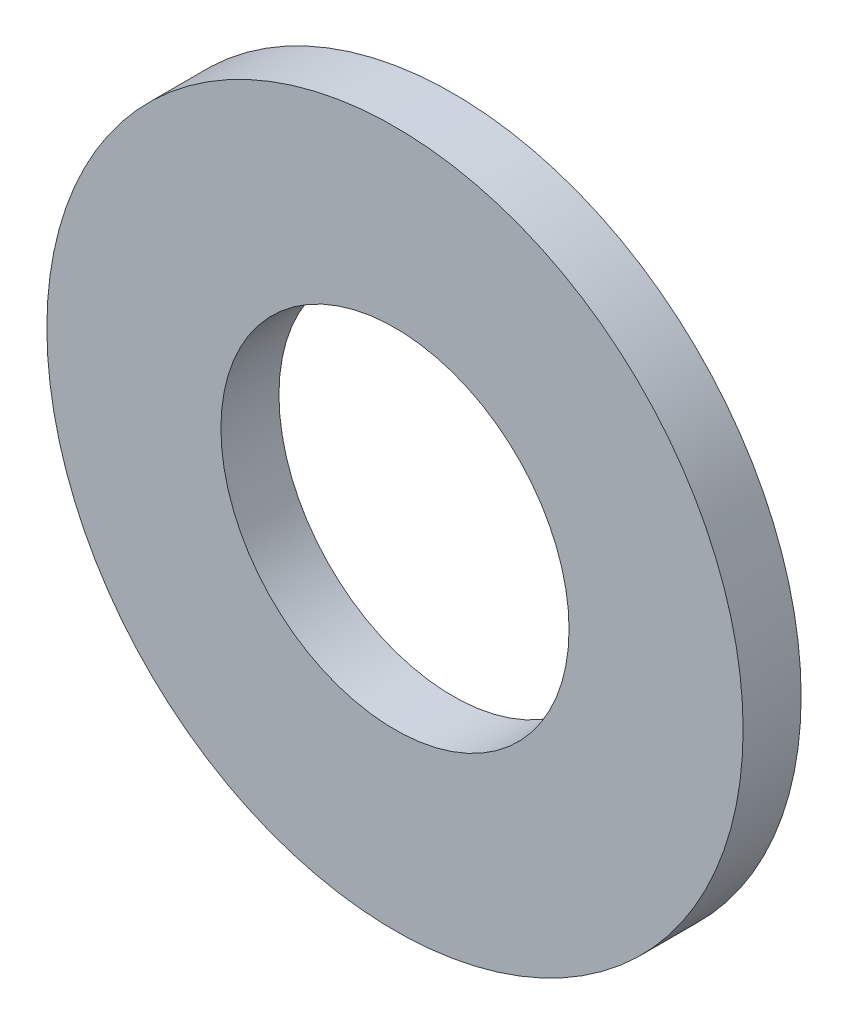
ISO-10303-21;
HEADER;
FILE_DESCRIPTION(('STEP AP214'),'2;1');
FILE_NAME('part.step','',(''),(''),'','','');
FILE_SCHEMA(('AUTOMOTIVE_DESIGN { 1 0 10303 214 1 1 1 1 }'));
ENDSEC;
DATA;
#1=APPLICATION_CONTEXT('core data for automotive mechanical design processes');
#2=APPLICATION_PROTOCOL_DEFINITION('international standard','automotive_design',2000,#1);
#3=PRODUCT_CONTEXT('',#1,'mechanical');
#4=PRODUCT('Part','Part','',(#3));
#5=PRODUCT_RELATED_PRODUCT_CATEGORY('part','',(#4));
#6=PRODUCT_DEFINITION_FORMATION('','',#4);
#7=PRODUCT_DEFINITION_CONTEXT('part definition',#1,'design');
#8=PRODUCT_DEFINITION('design','',#6,#7);
#9=PRODUCT_DEFINITION_SHAPE('','',#8);
#10=(LENGTH_UNIT() NAMED_UNIT(*) SI_UNIT(.MILLI.,.METRE.));
#11=(NAMED_UNIT(*) PLANE_ANGLE_UNIT() SI_UNIT($,.RADIAN.));
#12=(NAMED_UNIT(*) SI_UNIT($,.STERADIAN.) SOLID_ANGLE_UNIT());
#13=UNCERTAINTY_MEASURE_WITH_UNIT(LENGTH_MEASURE(1.E-05),#10,'distance_accuracy_value','');
#14=(GEOMETRIC_REPRESENTATION_CONTEXT(3) GLOBAL_UNCERTAINTY_ASSIGNED_CONTEXT((#13)) GLOBAL_UNIT_ASSIGNED_CONTEXT((#10,
#11,#12)) REPRESENTATION_CONTEXT('',''));
#15=CARTESIAN_POINT('',(0.,0.,0.));
#16=DIRECTION('',(0.,0.,1.));
#17=DIRECTION('',(1.,0.,0.));
#18=AXIS2_PLACEMENT_3D('',#15,#16,#17);
#19=CARTESIAN_POINT('',(0.,0.,0.));
#20=DIRECTION('',(0.,0.,1.));
#21=DIRECTION('',(1.,0.,0.));
#22=AXIS2_PLACEMENT_3D('',#19,#20,#21);
#23=CYLINDRICAL_SURFACE('',#22,4.5);
#24=CARTESIAN_POINT('',(0.,0.,1.5));
#25=DIRECTION('',(0.,0.,1.));
#26=DIRECTION('',(1.,0.,0.));
#27=AXIS2_PLACEMENT_3D('',#24,#25,#26);
#28=CIRCLE('',#27,4.5);
#29=CARTESIAN_POINT('',(4.5,0.,1.5));
#30=VERTEX_POINT('',#29);
#31=EDGE_CURVE('E10',#30,#30,#28,.T.);
#32=ORIENTED_EDGE('',*,*,#31,.T.);
#33=EDGE_LOOP('',(#32));
#34=FACE_BOUND('',#33,.T.);
#35=CARTESIAN_POINT('',(0.,0.,0.));
#36=DIRECTION('',(0.,0.,1.));
#37=DIRECTION('',(1.,0.,0.));
#38=AXIS2_PLACEMENT_3D('',#35,#36,#37);
#39=CIRCLE('',#38,4.5);
#40=CARTESIAN_POINT('',(4.5,0.,0.));
#41=VERTEX_POINT('',#40);
#42=EDGE_CURVE('E46',#41,#41,#39,.T.);
#43=ORIENTED_EDGE('',*,*,#42,.F.);
#44=EDGE_LOOP('',(#43));
#45=FACE_BOUND('',#44,.T.);
#46=ADVANCED_FACE('F32',(#34,#45),#23,.F.);
#47=CARTESIAN_POINT('',(4.5,0.,1.5));
#48=DIRECTION('',(0.,0.,1.));
#49=DIRECTION('',(1.,0.,0.));
#50=AXIS2_PLACEMENT_3D('',#47,#48,#49);
#51=PLANE('',#50);
#52=CARTESIAN_POINT('',(0.,0.,1.5));
#53=DIRECTION('',(0.,0.,1.));
#54=DIRECTION('',(1.,0.,0.));
#55=AXIS2_PLACEMENT_3D('',#52,#53,#54);
#56=CIRCLE('',#55,9.);
#57=CARTESIAN_POINT('',(9.,0.,1.5));
#58=VERTEX_POINT('',#57);
#59=EDGE_CURVE('E38',#58,#58,#56,.T.);
#60=ORIENTED_EDGE('',*,*,#59,.T.);
#61=EDGE_LOOP('',(#60));
#62=FACE_BOUND('',#61,.T.);
#63=ORIENTED_EDGE('',*,*,#31,.F.);
#64=EDGE_LOOP('',(#63));
#65=FACE_BOUND('',#64,.T.);
#66=ADVANCED_FACE('F56',(#62,#65),#51,.T.);
#67=CARTESIAN_POINT('',(0.,0.,0.));
#68=DIRECTION('',(0.,0.,1.));
#69=DIRECTION('',(1.,0.,0.));
#70=AXIS2_PLACEMENT_3D('',#67,#68,#69);
#71=CYLINDRICAL_SURFACE('',#70,9.);
#72=CARTESIAN_POINT('',(0.,0.,0.));
#73=DIRECTION('',(0.,0.,1.));
#74=DIRECTION('',(1.,0.,0.));
#75=AXIS2_PLACEMENT_3D('',#72,#73,#74);
#76=CIRCLE('',#75,9.);
#77=CARTESIAN_POINT('',(9.,0.,0.));
#78=VERTEX_POINT('',#77);
#79=EDGE_CURVE('E42',#78,#78,#76,.T.);
#80=ORIENTED_EDGE('',*,*,#79,.T.);
#81=EDGE_LOOP('',(#80));
#82=FACE_BOUND('',#81,.T.);
#83=ORIENTED_EDGE('',*,*,#59,.F.);
#84=EDGE_LOOP('',(#83));
#85=FACE_BOUND('',#84,.T.);
#86=ADVANCED_FACE('F60',(#82,#85),#71,.T.);
#87=CARTESIAN_POINT('',(9.,0.,0.));
#88=DIRECTION('',(0.,0.,-1.));
#89=DIRECTION('',(-1.,0.,0.));
#90=AXIS2_PLACEMENT_3D('',#87,#88,#89);
#91=PLANE('',#90);
#92=ORIENTED_EDGE('',*,*,#42,.T.);
#93=EDGE_LOOP('',(#92));
#94=FACE_BOUND('',#93,.T.);
#95=ORIENTED_EDGE('',*,*,#79,.F.);
#96=EDGE_LOOP('',(#95));
#97=FACE_BOUND('',#96,.T.);
#98=ADVANCED_FACE('F52',(#94,#97),#91,.T.);
#99=CLOSED_SHELL('',(#46,#66,#86,#98));
#100=MANIFOLD_SOLID_BREP('B2',#99);
#101=ADVANCED_BREP_SHAPE_REPRESENTATION('',(#18,#100),#14);
#102=SHAPE_DEFINITION_REPRESENTATION(#9,#101);
ENDSEC;
END-ISO-10303-21;
